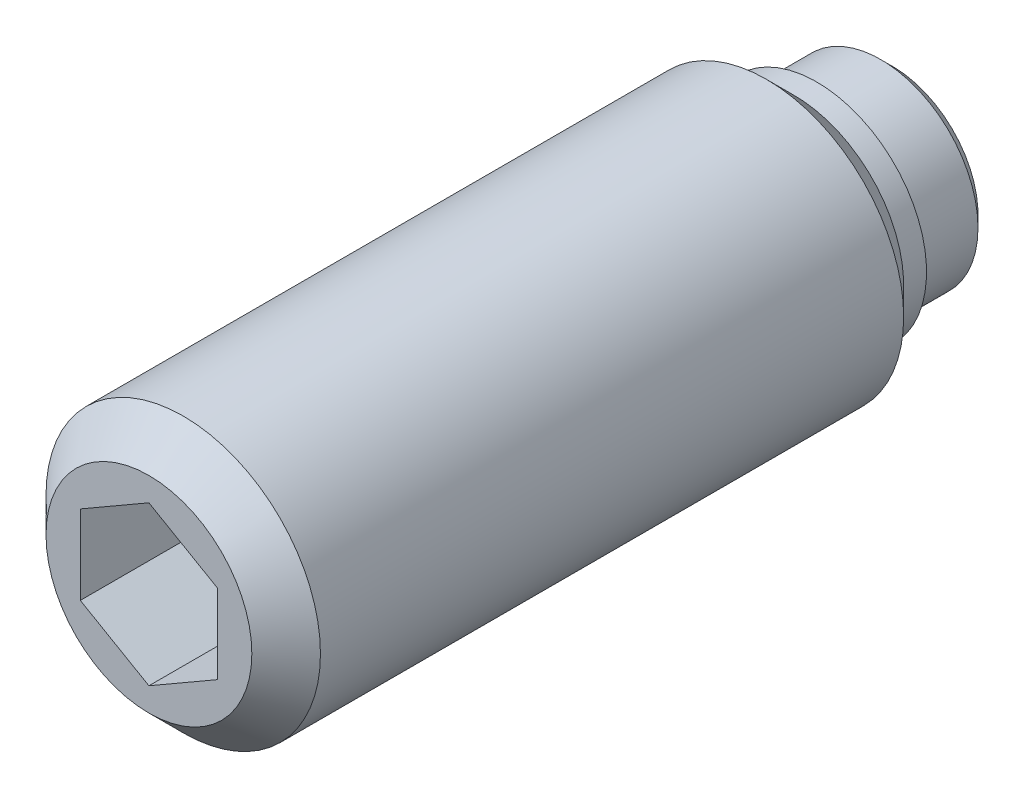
ISO-10303-21;
HEADER;
FILE_DESCRIPTION(('STEP AP214'),'2;1');
FILE_NAME('part.step','',(''),(''),'','','');
FILE_SCHEMA(('AUTOMOTIVE_DESIGN { 1 0 10303 214 1 1 1 1 }'));
ENDSEC;
DATA;
#1=APPLICATION_CONTEXT('core data for automotive mechanical design processes');
#2=APPLICATION_PROTOCOL_DEFINITION('international standard','automotive_design',2000,#1);
#3=PRODUCT_CONTEXT('',#1,'mechanical');
#4=PRODUCT('Part','Part','',(#3));
#5=PRODUCT_RELATED_PRODUCT_CATEGORY('part','',(#4));
#6=PRODUCT_DEFINITION_FORMATION('','',#4);
#7=PRODUCT_DEFINITION_CONTEXT('part definition',#1,'design');
#8=PRODUCT_DEFINITION('design','',#6,#7);
#9=PRODUCT_DEFINITION_SHAPE('','',#8);
#10=(LENGTH_UNIT() NAMED_UNIT(*) SI_UNIT(.MILLI.,.METRE.));
#11=(NAMED_UNIT(*) PLANE_ANGLE_UNIT() SI_UNIT($,.RADIAN.));
#12=(NAMED_UNIT(*) SI_UNIT($,.STERADIAN.) SOLID_ANGLE_UNIT());
#13=UNCERTAINTY_MEASURE_WITH_UNIT(LENGTH_MEASURE(1.E-05),#10,'distance_accuracy_value','');
#14=(GEOMETRIC_REPRESENTATION_CONTEXT(3) GLOBAL_UNCERTAINTY_ASSIGNED_CONTEXT((#13)) GLOBAL_UNIT_ASSIGNED_CONTEXT((#10,
#11,#12)) REPRESENTATION_CONTEXT('',''));
#15=CARTESIAN_POINT('',(0.,0.,0.));
#16=DIRECTION('',(0.,0.,1.));
#17=DIRECTION('',(1.,0.,0.));
#18=AXIS2_PLACEMENT_3D('',#15,#16,#17);
#19=CARTESIAN_POINT('',(0.,0.,3.3));
#20=DIRECTION('',(0.,0.,-1.));
#21=DIRECTION('',(-1.,0.,0.));
#22=AXIS2_PLACEMENT_3D('',#19,#20,#21);
#23=CYLINDRICAL_SURFACE('',#22,6.);
#24=CARTESIAN_POINT('',(0.,0.,5.5));
#25=DIRECTION('',(0.,0.,-1.));
#26=DIRECTION('',(-1.,0.,0.));
#27=AXIS2_PLACEMENT_3D('',#24,#25,#26);
#28=CIRCLE('',#27,6.);
#29=CARTESIAN_POINT('',(-6.,0.,5.5));
#30=VERTEX_POINT('',#29);
#31=EDGE_CURVE('E9',#30,#30,#28,.T.);
#32=ORIENTED_EDGE('',*,*,#31,.F.);
#33=EDGE_LOOP('',(#32));
#34=FACE_BOUND('',#33,.T.);
#35=CARTESIAN_POINT('',(0.,0.,31.));
#36=DIRECTION('',(0.,0.,1.));
#37=DIRECTION('',(1.,0.,0.));
#38=AXIS2_PLACEMENT_3D('',#35,#36,#37);
#39=CIRCLE('',#38,6.);
#40=CARTESIAN_POINT('',(6.,0.,31.));
#41=VERTEX_POINT('',#40);
#42=EDGE_CURVE('E123',#41,#41,#39,.T.);
#43=ORIENTED_EDGE('',*,*,#42,.F.);
#44=EDGE_LOOP('',(#43));
#45=FACE_BOUND('',#44,.T.);
#46=ADVANCED_FACE('F14',(#34,#45),#23,.T.);
#47=CARTESIAN_POINT('',(0.,0.,5.5));
#48=DIRECTION('',(0.,0.,1.));
#49=DIRECTION('',(1.,0.,0.));
#50=AXIS2_PLACEMENT_3D('',#47,#48,#49);
#51=CONICAL_SURFACE('',#50,6.,0.785398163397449);
#52=ORIENTED_EDGE('',*,*,#31,.T.);
#53=EDGE_LOOP('',(#52));
#54=FACE_BOUND('',#53,.T.);
#55=CARTESIAN_POINT('',(0.,0.,4.3));
#56=DIRECTION('',(0.,0.,-1.));
#57=DIRECTION('',(-1.,0.,0.));
#58=AXIS2_PLACEMENT_3D('',#55,#56,#57);
#59=CIRCLE('',#58,4.8);
#60=CARTESIAN_POINT('',(-4.8,0.,4.3));
#61=VERTEX_POINT('',#60);
#62=EDGE_CURVE('E21',#61,#61,#59,.T.);
#63=ORIENTED_EDGE('',*,*,#62,.F.);
#64=EDGE_LOOP('',(#63));
#65=FACE_BOUND('',#64,.T.);
#66=ADVANCED_FACE('F143',(#54,#65),#51,.T.);
#67=CARTESIAN_POINT('',(0.,0.,3.3));
#68=DIRECTION('',(0.,0.,-1.));
#69=DIRECTION('',(-1.,0.,0.));
#70=AXIS2_PLACEMENT_3D('',#67,#68,#69);
#71=CYLINDRICAL_SURFACE('',#70,4.8);
#72=ORIENTED_EDGE('',*,*,#62,.T.);
#73=EDGE_LOOP('',(#72));
#74=FACE_BOUND('',#73,.T.);
#75=CARTESIAN_POINT('',(0.,0.,3.3));
#76=DIRECTION('',(0.,0.,-1.));
#77=DIRECTION('',(-1.,0.,0.));
#78=AXIS2_PLACEMENT_3D('',#75,#76,#77);
#79=CIRCLE('',#78,4.8);
#80=CARTESIAN_POINT('',(-4.8,0.,3.3));
#81=VERTEX_POINT('',#80);
#82=EDGE_CURVE('E135',#81,#81,#79,.T.);
#83=ORIENTED_EDGE('',*,*,#82,.F.);
#84=EDGE_LOOP('',(#83));
#85=FACE_BOUND('',#84,.T.);
#86=ADVANCED_FACE('F140',(#74,#85),#71,.T.);
#87=CARTESIAN_POINT('',(0.,4.8,3.3));
#88=DIRECTION('',(0.,0.,1.));
#89=DIRECTION('',(1.,0.,0.));
#90=AXIS2_PLACEMENT_3D('',#87,#88,#89);
#91=PLANE('',#90);
#92=ORIENTED_EDGE('',*,*,#82,.T.);
#93=EDGE_LOOP('',(#92));
#94=FACE_BOUND('',#93,.T.);
#95=CARTESIAN_POINT('',(0.,0.,3.3));
#96=DIRECTION('',(0.,0.,-1.));
#97=DIRECTION('',(-1.,0.,0.));
#98=AXIS2_PLACEMENT_3D('',#95,#96,#97);
#99=CIRCLE('',#98,4.25);
#100=CARTESIAN_POINT('',(-4.25,0.,3.3));
#101=VERTEX_POINT('',#100);
#102=EDGE_CURVE('E132',#101,#101,#99,.T.);
#103=ORIENTED_EDGE('',*,*,#102,.F.);
#104=EDGE_LOOP('',(#103));
#105=FACE_BOUND('',#104,.T.);
#106=ADVANCED_FACE('F151',(#94,#105),#91,.F.);
#107=CARTESIAN_POINT('',(0.,0.,0.));
#108=DIRECTION('',(0.,0.,-1.));
#109=DIRECTION('',(-1.,0.,0.));
#110=AXIS2_PLACEMENT_3D('',#107,#108,#109);
#111=CYLINDRICAL_SURFACE('',#110,4.25);
#112=CARTESIAN_POINT('',(0.,0.,0.5));
#113=DIRECTION('',(0.,0.,-1.));
#114=DIRECTION('',(-1.,0.,0.));
#115=AXIS2_PLACEMENT_3D('',#112,#113,#114);
#116=CIRCLE('',#115,4.25);
#117=CARTESIAN_POINT('',(-4.25,0.,0.5));
#118=VERTEX_POINT('',#117);
#119=EDGE_CURVE('E129',#118,#118,#116,.T.);
#120=ORIENTED_EDGE('',*,*,#119,.F.);
#121=EDGE_LOOP('',(#120));
#122=FACE_BOUND('',#121,.T.);
#123=ORIENTED_EDGE('',*,*,#102,.T.);
#124=EDGE_LOOP('',(#123));
#125=FACE_BOUND('',#124,.T.);
#126=ADVANCED_FACE('F157',(#122,#125),#111,.T.);
#127=CARTESIAN_POINT('',(0.,0.,0.5));
#128=DIRECTION('',(0.,0.,1.));
#129=DIRECTION('',(1.,0.,0.));
#130=AXIS2_PLACEMENT_3D('',#127,#128,#129);
#131=CONICAL_SURFACE('',#130,4.25,0.785398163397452);
#132=CARTESIAN_POINT('',(0.,0.,0.));
#133=DIRECTION('',(0.,0.,-1.));
#134=DIRECTION('',(-1.,0.,0.));
#135=AXIS2_PLACEMENT_3D('',#132,#133,#134);
#136=CIRCLE('',#135,3.75);
#137=CARTESIAN_POINT('',(-3.75,0.,0.));
#138=VERTEX_POINT('',#137);
#139=EDGE_CURVE('E126',#138,#138,#136,.T.);
#140=ORIENTED_EDGE('',*,*,#139,.F.);
#141=EDGE_LOOP('',(#140));
#142=FACE_BOUND('',#141,.T.);
#143=ORIENTED_EDGE('',*,*,#119,.T.);
#144=EDGE_LOOP('',(#143));
#145=FACE_BOUND('',#144,.T.);
#146=ADVANCED_FACE('F161',(#142,#145),#131,.T.);
#147=CARTESIAN_POINT('',(0.,3.75,0.));
#148=DIRECTION('',(0.,0.,1.));
#149=DIRECTION('',(1.,0.,0.));
#150=AXIS2_PLACEMENT_3D('',#147,#148,#149);
#151=PLANE('',#150);
#152=ORIENTED_EDGE('',*,*,#139,.T.);
#153=EDGE_LOOP('',(#152));
#154=FACE_BOUND('',#153,.T.);
#155=ADVANCED_FACE('F165',(#154),#151,.F.);
#156=CARTESIAN_POINT('',(0.,0.,32.5));
#157=DIRECTION('',(0.,0.,-1.));
#158=DIRECTION('',(-1.,0.,0.));
#159=AXIS2_PLACEMENT_3D('',#156,#157,#158);
#160=CONICAL_SURFACE('',#159,4.5,0.785398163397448);
#161=ORIENTED_EDGE('',*,*,#42,.T.);
#162=EDGE_LOOP('',(#161));
#163=FACE_BOUND('',#162,.T.);
#164=CARTESIAN_POINT('',(0.,0.,32.5));
#165=DIRECTION('',(0.,0.,1.));
#166=DIRECTION('',(1.,0.,0.));
#167=AXIS2_PLACEMENT_3D('',#164,#165,#166);
#168=CIRCLE('',#167,4.5);
#169=CARTESIAN_POINT('',(4.5,0.,32.5));
#170=VERTEX_POINT('',#169);
#171=EDGE_CURVE('E115',#170,#170,#168,.T.);
#172=ORIENTED_EDGE('',*,*,#171,.F.);
#173=EDGE_LOOP('',(#172));
#174=FACE_BOUND('',#173,.T.);
#175=ADVANCED_FACE('F169',(#163,#174),#160,.T.);
#176=CARTESIAN_POINT('',(0.,-4.5,32.5));
#177=DIRECTION('',(0.,0.,1.));
#178=DIRECTION('',(1.,0.,0.));
#179=AXIS2_PLACEMENT_3D('',#176,#177,#178);
#180=PLANE('',#179);
#181=DIRECTION('',(0.866025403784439,-0.5,0.));
#182=VECTOR('',#181,1.);
#183=CARTESIAN_POINT('',(-3.,-1.73205080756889,32.5));
#184=LINE('',#183,#182);
#185=CARTESIAN_POINT('',(-3.,-1.73205080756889,32.5));
#186=VERTEX_POINT('',#185);
#187=CARTESIAN_POINT('',(0.,-3.46410161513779,32.5));
#188=VERTEX_POINT('',#187);
#189=EDGE_CURVE('E28',#186,#188,#184,.T.);
#190=ORIENTED_EDGE('',*,*,#189,.F.);
#191=DIRECTION('',(0.,-1.,0.));
#192=VECTOR('',#191,1.);
#193=CARTESIAN_POINT('',(-3.,1.73205080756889,32.5));
#194=LINE('',#193,#192);
#195=CARTESIAN_POINT('',(-3.,1.73205080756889,32.5));
#196=VERTEX_POINT('',#195);
#197=EDGE_CURVE('E111',#196,#186,#194,.T.);
#198=ORIENTED_EDGE('',*,*,#197,.F.);
#199=DIRECTION('',(-0.866025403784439,-0.5,0.));
#200=VECTOR('',#199,1.);
#201=CARTESIAN_POINT('',(0.,3.46410161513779,32.5));
#202=LINE('',#201,#200);
#203=CARTESIAN_POINT('',(0.,3.46410161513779,32.5));
#204=VERTEX_POINT('',#203);
#205=EDGE_CURVE('E109',#204,#196,#202,.T.);
#206=ORIENTED_EDGE('',*,*,#205,.F.);
#207=DIRECTION('',(-0.866025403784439,0.5,0.));
#208=VECTOR('',#207,1.);
#209=CARTESIAN_POINT('',(3.,1.73205080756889,32.5));
#210=LINE('',#209,#208);
#211=CARTESIAN_POINT('',(3.,1.73205080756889,32.5));
#212=VERTEX_POINT('',#211);
#213=EDGE_CURVE('E76',#212,#204,#210,.T.);
#214=ORIENTED_EDGE('',*,*,#213,.F.);
#215=DIRECTION('',(0.,1.,0.));
#216=VECTOR('',#215,1.);
#217=CARTESIAN_POINT('',(3.,-1.73205080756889,32.5));
#218=LINE('',#217,#216);
#219=CARTESIAN_POINT('',(3.,-1.73205080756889,32.5));
#220=VERTEX_POINT('',#219);
#221=EDGE_CURVE('E105',#220,#212,#218,.T.);
#222=ORIENTED_EDGE('',*,*,#221,.F.);
#223=DIRECTION('',(0.866025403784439,0.5,0.));
#224=VECTOR('',#223,1.);
#225=CARTESIAN_POINT('',(0.,-3.46410161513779,32.5));
#226=LINE('',#225,#224);
#227=EDGE_CURVE('E102',#188,#220,#226,.T.);
#228=ORIENTED_EDGE('',*,*,#227,.F.);
#229=EDGE_LOOP('',(#190,#198,#206,#214,#222,#228));
#230=FACE_BOUND('',#229,.T.);
#231=ORIENTED_EDGE('',*,*,#171,.T.);
#232=EDGE_LOOP('',(#231));
#233=FACE_BOUND('',#232,.T.);
#234=ADVANCED_FACE('F173',(#230,#233),#180,.T.);
#235=CARTESIAN_POINT('',(-3.,-1.73205080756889,24.5));
#236=DIRECTION('',(-0.5,-0.866025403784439,0.));
#237=DIRECTION('',(0.866025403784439,-0.5,0.));
#238=AXIS2_PLACEMENT_3D('',#235,#236,#237);
#239=PLANE('',#238);
#240=ORIENTED_EDGE('',*,*,#189,.T.);
#241=DIRECTION('',(0.,0.,1.));
#242=VECTOR('',#241,1.);
#243=CARTESIAN_POINT('',(0.,-3.46410161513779,24.5));
#244=LINE('',#243,#242);
#245=CARTESIAN_POINT('',(0.,-3.46410161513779,24.5));
#246=VERTEX_POINT('',#245);
#247=EDGE_CURVE('E58',#246,#188,#244,.T.);
#248=ORIENTED_EDGE('',*,*,#247,.F.);
#249=DIRECTION('',(0.866025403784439,-0.5,0.));
#250=VECTOR('',#249,1.);
#251=CARTESIAN_POINT('',(-3.,-1.73205080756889,24.5));
#252=LINE('',#251,#250);
#253=CARTESIAN_POINT('',(-3.,-1.73205080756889,24.5));
#254=VERTEX_POINT('',#253);
#255=EDGE_CURVE('E113',#254,#246,#252,.T.);
#256=ORIENTED_EDGE('',*,*,#255,.F.);
#257=DIRECTION('',(0.,0.,1.));
#258=VECTOR('',#257,1.);
#259=CARTESIAN_POINT('',(-3.,-1.73205080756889,24.5));
#260=LINE('',#259,#258);
#261=EDGE_CURVE('E36',#254,#186,#260,.T.);
#262=ORIENTED_EDGE('',*,*,#261,.T.);
#263=EDGE_LOOP('',(#240,#248,#256,#262));
#264=FACE_BOUND('',#263,.T.);
#265=ADVANCED_FACE('F177',(#264),#239,.F.);
#266=CARTESIAN_POINT('',(-3.,1.73205080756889,24.5));
#267=DIRECTION('',(-1.,0.,0.));
#268=DIRECTION('',(0.,0.,1.));
#269=AXIS2_PLACEMENT_3D('',#266,#267,#268);
#270=PLANE('',#269);
#271=ORIENTED_EDGE('',*,*,#197,.T.);
#272=ORIENTED_EDGE('',*,*,#261,.F.);
#273=DIRECTION('',(0.,-1.,0.));
#274=VECTOR('',#273,1.);
#275=CARTESIAN_POINT('',(-3.,1.73205080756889,24.5));
#276=LINE('',#275,#274);
#277=CARTESIAN_POINT('',(-3.,1.73205080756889,24.5));
#278=VERTEX_POINT('',#277);
#279=EDGE_CURVE('E88',#278,#254,#276,.T.);
#280=ORIENTED_EDGE('',*,*,#279,.F.);
#281=DIRECTION('',(0.,0.,1.));
#282=VECTOR('',#281,1.);
#283=CARTESIAN_POINT('',(-3.,1.73205080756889,24.5));
#284=LINE('',#283,#282);
#285=EDGE_CURVE('E80',#278,#196,#284,.T.);
#286=ORIENTED_EDGE('',*,*,#285,.T.);
#287=EDGE_LOOP('',(#271,#272,#280,#286));
#288=FACE_BOUND('',#287,.T.);
#289=ADVANCED_FACE('F181',(#288),#270,.F.);
#290=CARTESIAN_POINT('',(0.,3.46410161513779,24.5));
#291=DIRECTION('',(-0.5,0.866025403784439,0.));
#292=DIRECTION('',(-0.866025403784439,-0.5,0.));
#293=AXIS2_PLACEMENT_3D('',#290,#291,#292);
#294=PLANE('',#293);
#295=ORIENTED_EDGE('',*,*,#205,.T.);
#296=ORIENTED_EDGE('',*,*,#285,.F.);
#297=DIRECTION('',(-0.866025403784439,-0.5,0.));
#298=VECTOR('',#297,1.);
#299=CARTESIAN_POINT('',(0.,3.46410161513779,24.5));
#300=LINE('',#299,#298);
#301=CARTESIAN_POINT('',(0.,3.46410161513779,24.5));
#302=VERTEX_POINT('',#301);
#303=EDGE_CURVE('E84',#302,#278,#300,.T.);
#304=ORIENTED_EDGE('',*,*,#303,.F.);
#305=DIRECTION('',(0.,0.,1.));
#306=VECTOR('',#305,1.);
#307=CARTESIAN_POINT('',(0.,3.46410161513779,24.5));
#308=LINE('',#307,#306);
#309=EDGE_CURVE('E69',#302,#204,#308,.T.);
#310=ORIENTED_EDGE('',*,*,#309,.T.);
#311=EDGE_LOOP('',(#295,#296,#304,#310));
#312=FACE_BOUND('',#311,.T.);
#313=ADVANCED_FACE('F85',(#312),#294,.F.);
#314=CARTESIAN_POINT('',(3.,1.73205080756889,24.5));
#315=DIRECTION('',(0.5,0.866025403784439,0.));
#316=DIRECTION('',(-0.866025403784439,0.5,0.));
#317=AXIS2_PLACEMENT_3D('',#314,#315,#316);
#318=PLANE('',#317);
#319=ORIENTED_EDGE('',*,*,#213,.T.);
#320=ORIENTED_EDGE('',*,*,#309,.F.);
#321=DIRECTION('',(-0.866025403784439,0.5,0.));
#322=VECTOR('',#321,1.);
#323=CARTESIAN_POINT('',(3.,1.73205080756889,24.5));
#324=LINE('',#323,#322);
#325=CARTESIAN_POINT('',(3.,1.73205080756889,24.5));
#326=VERTEX_POINT('',#325);
#327=EDGE_CURVE('E73',#326,#302,#324,.T.);
#328=ORIENTED_EDGE('',*,*,#327,.F.);
#329=DIRECTION('',(0.,0.,1.));
#330=VECTOR('',#329,1.);
#331=CARTESIAN_POINT('',(3.,1.73205080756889,24.5));
#332=LINE('',#331,#330);
#333=EDGE_CURVE('E81',#326,#212,#332,.T.);
#334=ORIENTED_EDGE('',*,*,#333,.T.);
#335=EDGE_LOOP('',(#319,#320,#328,#334));
#336=FACE_BOUND('',#335,.T.);
#337=ADVANCED_FACE('F71',(#336),#318,.F.);
#338=CARTESIAN_POINT('',(3.,-1.73205080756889,24.5));
#339=DIRECTION('',(1.,0.,0.));
#340=DIRECTION('',(0.,0.,-1.));
#341=AXIS2_PLACEMENT_3D('',#338,#339,#340);
#342=PLANE('',#341);
#343=ORIENTED_EDGE('',*,*,#221,.T.);
#344=ORIENTED_EDGE('',*,*,#333,.F.);
#345=DIRECTION('',(0.,1.,0.));
#346=VECTOR('',#345,1.);
#347=CARTESIAN_POINT('',(3.,-1.73205080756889,24.5));
#348=LINE('',#347,#346);
#349=CARTESIAN_POINT('',(3.,-1.73205080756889,24.5));
#350=VERTEX_POINT('',#349);
#351=EDGE_CURVE('E94',#350,#326,#348,.T.);
#352=ORIENTED_EDGE('',*,*,#351,.F.);
#353=DIRECTION('',(0.,0.,1.));
#354=VECTOR('',#353,1.);
#355=CARTESIAN_POINT('',(3.,-1.73205080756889,24.5));
#356=LINE('',#355,#354);
#357=EDGE_CURVE('E118',#350,#220,#356,.T.);
#358=ORIENTED_EDGE('',*,*,#357,.T.);
#359=EDGE_LOOP('',(#343,#344,#352,#358));
#360=FACE_BOUND('',#359,.T.);
#361=ADVANCED_FACE('F185',(#360),#342,.F.);
#362=CARTESIAN_POINT('',(0.,-3.46410161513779,24.5));
#363=DIRECTION('',(0.5,-0.866025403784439,0.));
#364=DIRECTION('',(0.866025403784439,0.5,0.));
#365=AXIS2_PLACEMENT_3D('',#362,#363,#364);
#366=PLANE('',#365);
#367=ORIENTED_EDGE('',*,*,#227,.T.);
#368=ORIENTED_EDGE('',*,*,#357,.F.);
#369=DIRECTION('',(0.866025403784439,0.5,0.));
#370=VECTOR('',#369,1.);
#371=CARTESIAN_POINT('',(0.,-3.46410161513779,24.5));
#372=LINE('',#371,#370);
#373=EDGE_CURVE('E96',#246,#350,#372,.T.);
#374=ORIENTED_EDGE('',*,*,#373,.F.);
#375=ORIENTED_EDGE('',*,*,#247,.T.);
#376=EDGE_LOOP('',(#367,#368,#374,#375));
#377=FACE_BOUND('',#376,.T.);
#378=ADVANCED_FACE('F182',(#377),#366,.F.);
#379=CARTESIAN_POINT('',(0.,0.,24.5));
#380=DIRECTION('',(0.,0.,1.));
#381=DIRECTION('',(1.,0.,0.));
#382=AXIS2_PLACEMENT_3D('',#379,#380,#381);
#383=PLANE('',#382);
#384=ORIENTED_EDGE('',*,*,#255,.T.);
#385=ORIENTED_EDGE('',*,*,#373,.T.);
#386=ORIENTED_EDGE('',*,*,#351,.T.);
#387=ORIENTED_EDGE('',*,*,#327,.T.);
#388=ORIENTED_EDGE('',*,*,#303,.T.);
#389=ORIENTED_EDGE('',*,*,#279,.T.);
#390=EDGE_LOOP('',(#384,#385,#386,#387,#388,#389));
#391=FACE_BOUND('',#390,.T.);
#392=ADVANCED_FACE('F91',(#391),#383,.T.);
#393=CLOSED_SHELL('',(#46,#66,#86,#106,#126,#146,#155,#175,#234,#265,#289,#313,#337,#361,#378,#392));
#394=MANIFOLD_SOLID_BREP('B1',#393);
#395=ADVANCED_BREP_SHAPE_REPRESENTATION('',(#18,#394),#14);
#396=SHAPE_DEFINITION_REPRESENTATION(#9,#395);
ENDSEC;
END-ISO-10303-21;
